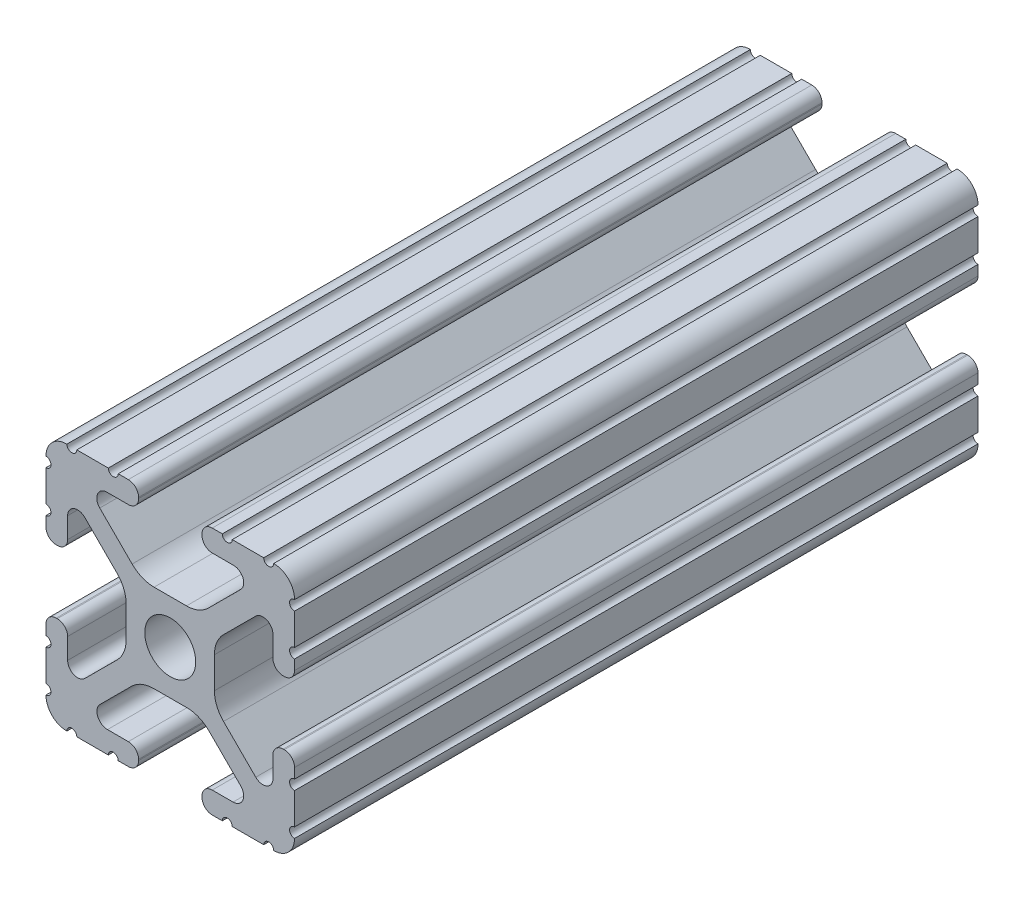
from build123d import *

# Parameters (mm, degrees)
SKETCH1_R           = 2.6035
BOSS_EXTRUDE1_DEPTH = 34.925


with BuildPart() as part:
    # Sketch1 → Boss-Extrude1 (new, symmetric)
    with BuildSketch(Plane.XY):
        with BuildLine():
            Line((-7.179650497, -8.645192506), (-3.952270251, -5.423690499))
            ThreePointArc((-3.952270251, -5.423690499), (-2.922936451, -4.736929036), (-1.709253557, -4.4958))
            Line((-1.709253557, -4.4958), (1.709253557, -4.4958))
            ThreePointArc((1.709253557, -4.4958), (2.922936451, -4.736929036), (3.952270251, -5.423690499))
            Line((3.952270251, -5.423690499), (7.179650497, -8.645192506))
            ThreePointArc((7.179650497, -8.645192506), (7.41473083, -9.822813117), (6.416408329, -10.4902))
            Line((6.416408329, -10.4902), (4.287512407, -10.4902))
            ThreePointArc((4.287512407, -10.4902), (3.54574862, -10.79744862), (3.2385, -11.539212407))
            Line((3.2385, -11.539212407), (3.2385, -11.650987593))
            ThreePointArc((3.2385, -11.650987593), (3.54574862, -12.39275138), (4.287512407, -12.7))
            Line((4.287512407, -12.7), (5.317126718, -12.7))
            ThreePointArc((5.317126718, -12.7), (5.825126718, -12.192), (6.333126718, -12.7))
            Line((6.333126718, -12.7), (9.550443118, -12.7))
            ThreePointArc((9.550443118, -12.7), (10.058366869, -12.192000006), (10.566443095, -12.699847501))
            ThreePointArc((10.566443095, -12.699847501), (12.082537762, -12.08250727), (12.699846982, -10.566399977))
            ThreePointArc((12.699846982, -10.566399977), (12.192000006, -10.058323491), (12.7, -9.5504))
            Line((12.7, -9.5504), (12.7, -6.3330836))
            ThreePointArc((12.7, -6.3330836), (12.192, -5.8250836), (12.7, -5.3170836))
            Line((12.7, -5.3170836), (12.7, -4.287469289))
            ThreePointArc((12.7, -4.287469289), (12.39275138, -3.545705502), (11.650987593, -3.238456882))
            Line((11.650987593, -3.238456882), (11.539212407, -3.238456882))
            ThreePointArc((11.539212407, -3.238456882), (10.79744862, -3.545705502), (10.4902, -4.287469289))
            Line((10.4902, -4.287469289), (10.4902, -6.402089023))
            ThreePointArc((10.4902, -6.402089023), (9.856505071, -7.351067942), (8.737131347, -7.129408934))
            Line((8.737131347, -7.129408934), (5.441005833, -3.840816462))
            ThreePointArc((5.441005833, -3.840816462), (4.750877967, -2.809883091), (4.5085, -1.593185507))
            Line((4.5085, -1.593185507), (4.5085, 1.593185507))
            ThreePointArc((4.5085, 1.593185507), (4.750877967, 2.809883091), (5.441005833, 3.840816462))
            Line((5.441005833, 3.840816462), (8.737131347, 7.129408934))
            ThreePointArc((8.737131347, 7.129408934), (9.856505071, 7.351067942), (10.4902, 6.402089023))
            Line((10.4902, 6.402089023), (10.4902, 4.287469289))
            ThreePointArc((10.4902, 4.287469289), (10.79744862, 3.545705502), (11.539212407, 3.238456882))
            Line((11.539212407, 3.238456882), (11.650987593, 3.238456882))
            ThreePointArc((11.650987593, 3.238456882), (12.39275138, 3.545705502), (12.7, 4.287469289))
            Line((12.7, 4.287469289), (12.7, 5.3170836))
            ThreePointArc((12.7, 5.3170836), (12.192, 5.8250836), (12.7, 6.3330836))
            Line((12.7, 6.3330836), (12.7, 9.5504))
            ThreePointArc((12.7, 9.5504), (12.192000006, 10.058323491), (12.699846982, 10.566399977))
            ThreePointArc((12.699846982, 10.566399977), (12.082537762, 12.08250727), (10.566443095, 12.699847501))
            ThreePointArc((10.566443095, 12.699847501), (10.058366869, 12.192000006), (9.550443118, 12.7))
            Line((9.550443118, 12.7), (6.333126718, 12.7))
            ThreePointArc((6.333126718, 12.7), (5.825126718, 12.192), (5.317126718, 12.7))
            Line((5.317126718, 12.7), (4.287512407, 12.7))
            ThreePointArc((4.287512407, 12.7), (3.54574862, 12.39275138), (3.2385, 11.650987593))
            Line((3.2385, 11.650987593), (3.2385, 11.539212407))
            ThreePointArc((3.2385, 11.539212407), (3.54574862, 10.79744862), (4.287512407, 10.4902))
            Line((4.287512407, 10.4902), (6.476788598, 10.4902))
            ThreePointArc((6.476788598, 10.4902), (7.432222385, 9.85140422), (7.207036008, 8.724370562))
            Line((7.207036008, 8.724370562), (3.898272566, 5.423169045))
            ThreePointArc((3.898272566, 5.423169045), (2.869120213, 4.736787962), (1.655778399, 4.4958))
            Line((1.655778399, 4.4958), (-1.655778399, 4.4958))
            ThreePointArc((-1.655778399, 4.4958), (-2.869120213, 4.736787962), (-3.898272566, 5.423169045))
            Line((-3.898272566, 5.423169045), (-7.207036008, 8.724370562))
            ThreePointArc((-7.207036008, 8.724370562), (-7.432222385, 9.85140422), (-6.476788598, 10.4902))
            Line((-6.476788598, 10.4902), (-4.287512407, 10.4902))
            ThreePointArc((-4.287512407, 10.4902), (-3.54574862, 10.79744862), (-3.2385, 11.539212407))
            Line((-3.2385, 11.539212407), (-3.2385, 11.650987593))
            ThreePointArc((-3.2385, 11.650987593), (-3.54574862, 12.39275138), (-4.287512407, 12.7))
            Line((-4.287512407, 12.7), (-5.317126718, 12.7))
            ThreePointArc((-5.317126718, 12.7), (-5.825126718, 12.192), (-6.333126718, 12.7))
            Line((-6.333126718, 12.7), (-9.550443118, 12.7))
            ThreePointArc((-9.550443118, 12.7), (-10.058366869, 12.192000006), (-10.566443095, 12.699847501))
            ThreePointArc((-10.566443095, 12.699847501), (-12.082537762, 12.08250727), (-12.699846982, 10.566399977))
            ThreePointArc((-12.699846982, 10.566399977), (-12.192000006, 10.058323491), (-12.7, 9.5504))
            Line((-12.7, 9.5504), (-12.7, 6.3330836))
            ThreePointArc((-12.7, 6.3330836), (-12.192, 5.8250836), (-12.7, 5.3170836))
            Line((-12.7, 5.3170836), (-12.7, 4.287469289))
            ThreePointArc((-12.7, 4.287469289), (-12.39275138, 3.545705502), (-11.650987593, 3.238456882))
            Line((-11.650987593, 3.238456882), (-11.539212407, 3.238456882))
            ThreePointArc((-11.539212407, 3.238456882), (-10.79744862, 3.545705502), (-10.4902, 4.287469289))
            Line((-10.4902, 4.287469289), (-10.4902, 6.402089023))
            ThreePointArc((-10.4902, 6.402089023), (-9.856505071, 7.351067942), (-8.737131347, 7.129408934))
            Line((-8.737131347, 7.129408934), (-5.441005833, 3.840816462))
            ThreePointArc((-5.441005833, 3.840816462), (-4.750877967, 2.809883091), (-4.5085, 1.593185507))
            Line((-4.5085, 1.593185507), (-4.5085, -1.593185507))
            ThreePointArc((-4.5085, -1.593185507), (-4.750877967, -2.809883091), (-5.441005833, -3.840816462))
            Line((-5.441005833, -3.840816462), (-8.737131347, -7.129408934))
            ThreePointArc((-8.737131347, -7.129408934), (-9.856505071, -7.351067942), (-10.4902, -6.402089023))
            Line((-10.4902, -6.402089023), (-10.4902, -4.287469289))
            ThreePointArc((-10.4902, -4.287469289), (-10.79744862, -3.545705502), (-11.539212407, -3.238456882))
            Line((-11.539212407, -3.238456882), (-11.650987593, -3.238456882))
            ThreePointArc((-11.650987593, -3.238456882), (-12.39275138, -3.545705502), (-12.7, -4.287469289))
            Line((-12.7, -4.287469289), (-12.7, -5.3170836))
            ThreePointArc((-12.7, -5.3170836), (-12.192, -5.8250836), (-12.7, -6.3330836))
            Line((-12.7, -6.3330836), (-12.7, -9.5504))
            ThreePointArc((-12.7, -9.5504), (-12.192000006, -10.058323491), (-12.699846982, -10.566399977))
            ThreePointArc((-12.699846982, -10.566399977), (-12.082537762, -12.08250727), (-10.566443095, -12.699847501))
            ThreePointArc((-10.566443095, -12.699847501), (-10.058366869, -12.192000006), (-9.550443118, -12.7))
            Line((-9.550443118, -12.7), (-6.333126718, -12.7))
            ThreePointArc((-6.333126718, -12.7), (-5.825126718, -12.192), (-5.317126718, -12.7))
            Line((-5.317126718, -12.7), (-4.287512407, -12.7))
            ThreePointArc((-4.287512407, -12.7), (-3.54574862, -12.39275138), (-3.2385, -11.650987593))
            Line((-3.2385, -11.650987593), (-3.2385, -11.539212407))
            ThreePointArc((-3.2385, -11.539212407), (-3.54574862, -10.79744862), (-4.287512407, -10.4902))
            Line((-4.287512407, -10.4902), (-6.416408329, -10.4902))
            ThreePointArc((-6.416408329, -10.4902), (-7.41473083, -9.822813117), (-7.179650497, -8.645192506))
        make_face()
        Circle(SKETCH1_R, mode=Mode.SUBTRACT)
    extrude(amount=BOSS_EXTRUDE1_DEPTH, both=True)


solid = part.part
